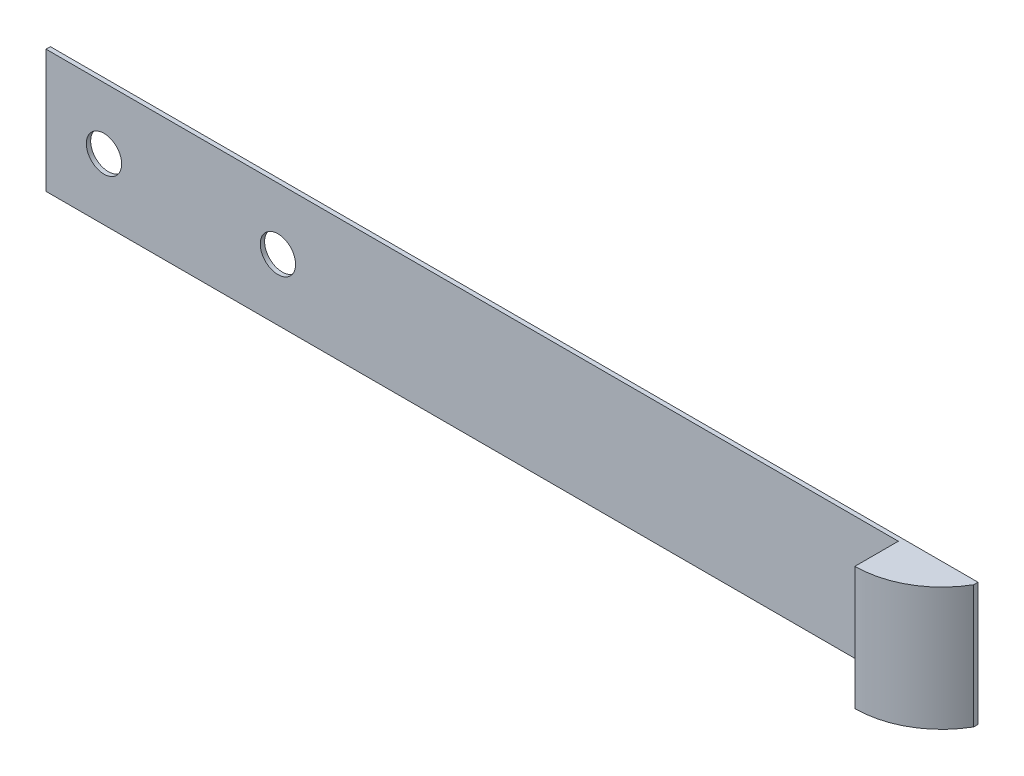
from build123d import *

# Parameters (mm, degrees)
SKETCH1_W                 = 64
SKETCH1_H                 = 8.5
EXTRUDE1_DEPTH            = 0.3
EXTRUDE2_DEPTH            = 8.5
F_2_CLEARANCE_HOLE1_D     = 2.4384
F_2_CLEARANCE_HOLE1_DEPTH = 12
F_2_CLEARANCE_HOLE1_TIP   = 0.732569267


with BuildPart() as part:
    # Sketch1 → Extrude1 (new body)
    with BuildSketch(Plane.XY):
        with Locations((16, 0)):
            Rectangle(SKETCH1_W, SKETCH1_H)
    extrude(amount=EXTRUDE1_DEPTH)

    # Sketch3 → Extrude2 (add)
    with BuildSketch(Plane.XZ.offset(4.25)):
        with BuildLine():
            Line((42.803847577, 3.3), (42.803847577, 0.3))
            Line((42.803847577, 0.3), (48, 0.3))
            ThreePointArc((48, 0.3), (45.803847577, 2.496152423), (42.803847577, 3.3))
        make_face()
    extrude(amount=-EXTRUDE2_DEPTH)

    # 2 Clearance Hole1
    with Locations(Plane(origin=(0, 0, 0), x_dir=(-1, 0, 0), z_dir=(0, 0, -1))):
        with Locations((12, 0), (0, 0)):
            Hole(F_2_CLEARANCE_HOLE1_D / 2, depth=F_2_CLEARANCE_HOLE1_DEPTH)
            with Locations((0, 0, -(F_2_CLEARANCE_HOLE1_DEPTH + F_2_CLEARANCE_HOLE1_TIP / 2))):  # 118° drill point
                Cone(0, F_2_CLEARANCE_HOLE1_D / 2, F_2_CLEARANCE_HOLE1_TIP, mode=Mode.SUBTRACT)


solid = part.part
